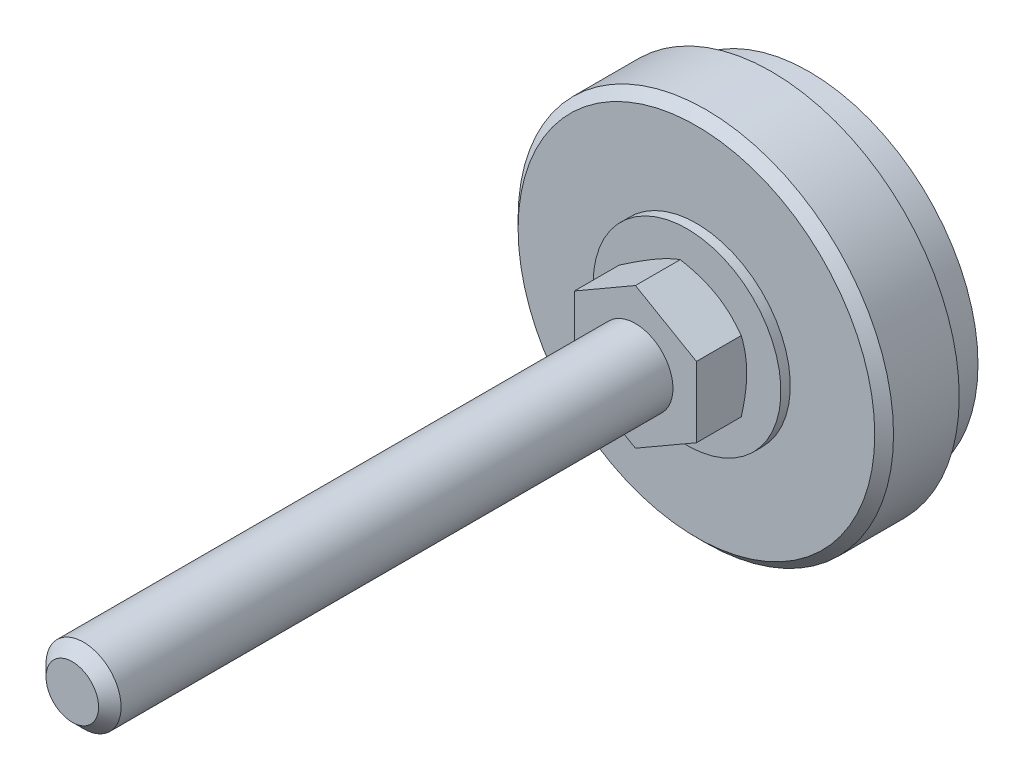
ISO-10303-21;
HEADER;
FILE_DESCRIPTION(('STEP AP214'),'2;1');
FILE_NAME('part.step','',(''),(''),'','','');
FILE_SCHEMA(('AUTOMOTIVE_DESIGN { 1 0 10303 214 1 1 1 1 }'));
ENDSEC;
DATA;
#1=APPLICATION_CONTEXT('core data for automotive mechanical design processes');
#2=APPLICATION_PROTOCOL_DEFINITION('international standard','automotive_design',2000,#1);
#3=PRODUCT_CONTEXT('',#1,'mechanical');
#4=PRODUCT('Part','Part','',(#3));
#5=PRODUCT_RELATED_PRODUCT_CATEGORY('part','',(#4));
#6=PRODUCT_DEFINITION_FORMATION('','',#4);
#7=PRODUCT_DEFINITION_CONTEXT('part definition',#1,'design');
#8=PRODUCT_DEFINITION('design','',#6,#7);
#9=PRODUCT_DEFINITION_SHAPE('','',#8);
#10=(LENGTH_UNIT() NAMED_UNIT(*) SI_UNIT(.MILLI.,.METRE.));
#11=(NAMED_UNIT(*) PLANE_ANGLE_UNIT() SI_UNIT($,.RADIAN.));
#12=(NAMED_UNIT(*) SI_UNIT($,.STERADIAN.) SOLID_ANGLE_UNIT());
#13=UNCERTAINTY_MEASURE_WITH_UNIT(LENGTH_MEASURE(1.E-05),#10,'distance_accuracy_value','');
#14=(GEOMETRIC_REPRESENTATION_CONTEXT(3) GLOBAL_UNCERTAINTY_ASSIGNED_CONTEXT((#13)) GLOBAL_UNIT_ASSIGNED_CONTEXT((#10,
#11,#12)) REPRESENTATION_CONTEXT('',''));
#15=CARTESIAN_POINT('',(0.,0.,0.));
#16=DIRECTION('',(0.,0.,1.));
#17=DIRECTION('',(1.,0.,0.));
#18=AXIS2_PLACEMENT_3D('',#15,#16,#17);
#19=CARTESIAN_POINT('',(0.,0.,18.5));
#20=DIRECTION('',(0.,0.,1.));
#21=DIRECTION('',(1.,0.,0.));
#22=AXIS2_PLACEMENT_3D('',#19,#20,#21);
#23=PLANE('',#22);
#24=DIRECTION('',(-0.866025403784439,0.5,0.));
#25=VECTOR('',#24,1.);
#26=CARTESIAN_POINT('',(6.5,3.75277674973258,18.5));
#27=LINE('',#26,#25);
#28=CARTESIAN_POINT('',(6.5,3.75277674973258,18.5));
#29=VERTEX_POINT('',#28);
#30=CARTESIAN_POINT('',(0.,7.50555349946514,18.5));
#31=VERTEX_POINT('',#30);
#32=EDGE_CURVE('E225',#29,#31,#27,.T.);
#33=ORIENTED_EDGE('',*,*,#32,.T.);
#34=DIRECTION('',(-0.866025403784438,-0.5,0.));
#35=VECTOR('',#34,1.);
#36=CARTESIAN_POINT('',(0.,7.50555349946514,18.5));
#37=LINE('',#36,#35);
#38=CARTESIAN_POINT('',(-6.5,3.75277674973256,18.5));
#39=VERTEX_POINT('',#38);
#40=EDGE_CURVE('E372',#31,#39,#37,.T.);
#41=ORIENTED_EDGE('',*,*,#40,.T.);
#42=DIRECTION('',(0.,-1.,0.));
#43=VECTOR('',#42,1.);
#44=CARTESIAN_POINT('',(-6.5,3.75277674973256,18.5));
#45=LINE('',#44,#43);
#46=CARTESIAN_POINT('',(-6.5,-3.75277674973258,18.5));
#47=VERTEX_POINT('',#46);
#48=EDGE_CURVE('E371',#39,#47,#45,.T.);
#49=ORIENTED_EDGE('',*,*,#48,.T.);
#50=DIRECTION('',(0.866025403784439,-0.5,0.));
#51=VECTOR('',#50,1.);
#52=CARTESIAN_POINT('',(-6.5,-3.75277674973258,18.5));
#53=LINE('',#52,#51);
#54=CARTESIAN_POINT('',(0.,-7.50555349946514,18.5));
#55=VERTEX_POINT('',#54);
#56=EDGE_CURVE('E376',#47,#55,#53,.T.);
#57=ORIENTED_EDGE('',*,*,#56,.T.);
#58=DIRECTION('',(0.866025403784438,0.5,0.));
#59=VECTOR('',#58,1.);
#60=CARTESIAN_POINT('',(0.,-7.50555349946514,18.5));
#61=LINE('',#60,#59);
#62=CARTESIAN_POINT('',(6.5,-3.75277674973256,18.5));
#63=VERTEX_POINT('',#62);
#64=EDGE_CURVE('E378',#55,#63,#61,.T.);
#65=ORIENTED_EDGE('',*,*,#64,.T.);
#66=DIRECTION('',(0.,1.,0.));
#67=VECTOR('',#66,1.);
#68=CARTESIAN_POINT('',(6.5,-3.75277674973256,18.5));
#69=LINE('',#68,#67);
#70=EDGE_CURVE('E37',#63,#29,#69,.T.);
#71=ORIENTED_EDGE('',*,*,#70,.T.);
#72=EDGE_LOOP('',(#33,#41,#49,#57,#65,#71));
#73=FACE_BOUND('',#72,.T.);
#74=CARTESIAN_POINT('',(0.,0.,18.5));
#75=DIRECTION('',(0.,0.,1.));
#76=DIRECTION('',(1.,0.,0.));
#77=AXIS2_PLACEMENT_3D('',#74,#75,#76);
#78=CIRCLE('',#77,4.);
#79=CARTESIAN_POINT('',(4.,0.,18.5));
#80=VERTEX_POINT('',#79);
#81=EDGE_CURVE('E229',#80,#80,#78,.T.);
#82=ORIENTED_EDGE('',*,*,#81,.F.);
#83=EDGE_LOOP('',(#82));
#84=FACE_BOUND('',#83,.T.);
#85=ADVANCED_FACE('F14',(#73,#84),#23,.T.);
#86=CARTESIAN_POINT('',(0.,0.,13.));
#87=DIRECTION('',(0.,0.,-1.));
#88=DIRECTION('',(-1.,0.,0.));
#89=AXIS2_PLACEMENT_3D('',#86,#87,#88);
#90=PLANE('',#89);
#91=CARTESIAN_POINT('',(0.,0.,13.));
#92=DIRECTION('',(0.,0.,-1.));
#93=DIRECTION('',(-1.,0.,0.));
#94=AXIS2_PLACEMENT_3D('',#91,#92,#93);
#95=CIRCLE('',#94,10.);
#96=CARTESIAN_POINT('',(-10.,0.,13.));
#97=VERTEX_POINT('',#96);
#98=EDGE_CURVE('E73',#97,#97,#95,.T.);
#99=ORIENTED_EDGE('',*,*,#98,.F.);
#100=EDGE_LOOP('',(#99));
#101=FACE_BOUND('',#100,.T.);
#102=CARTESIAN_POINT('',(0.,0.,13.));
#103=DIRECTION('',(0.,0.,-1.));
#104=DIRECTION('',(-1.,0.,0.));
#105=AXIS2_PLACEMENT_3D('',#102,#103,#104);
#106=CIRCLE('',#105,6.25);
#107=CARTESIAN_POINT('',(-6.25,0.,13.));
#108=VERTEX_POINT('',#107);
#109=EDGE_CURVE('E84',#108,#108,#106,.T.);
#110=ORIENTED_EDGE('',*,*,#109,.T.);
#111=EDGE_LOOP('',(#110));
#112=FACE_BOUND('',#111,.T.);
#113=ADVANCED_FACE('F210',(#101,#112),#90,.F.);
#114=CARTESIAN_POINT('',(18.,0.,0.));
#115=DIRECTION('',(0.,0.,1.));
#116=DIRECTION('',(1.,0.,0.));
#117=AXIS2_PLACEMENT_3D('',#114,#115,#116);
#118=PLANE('',#117);
#119=CARTESIAN_POINT('',(0.,0.,0.));
#120=DIRECTION('',(0.,0.,-1.));
#121=DIRECTION('',(-1.,0.,0.));
#122=AXIS2_PLACEMENT_3D('',#119,#120,#121);
#123=CIRCLE('',#122,18.);
#124=CARTESIAN_POINT('',(-18.,0.,0.));
#125=VERTEX_POINT('',#124);
#126=EDGE_CURVE('E102',#125,#125,#123,.T.);
#127=ORIENTED_EDGE('',*,*,#126,.T.);
#128=EDGE_LOOP('',(#127));
#129=FACE_BOUND('',#128,.T.);
#130=ADVANCED_FACE('F208',(#129),#118,.F.);
#131=CARTESIAN_POINT('',(0.,0.,-17.5528627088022));
#132=DIRECTION('',(0.,0.,-1.));
#133=DIRECTION('',(-1.,0.,0.));
#134=AXIS2_PLACEMENT_3D('',#131,#132,#133);
#135=CYLINDRICAL_SURFACE('',#134,10.);
#136=CARTESIAN_POINT('',(0.,0.,12.));
#137=DIRECTION('',(0.,0.,-1.));
#138=DIRECTION('',(-1.,0.,0.));
#139=AXIS2_PLACEMENT_3D('',#136,#137,#138);
#140=CIRCLE('',#139,10.);
#141=CARTESIAN_POINT('',(-10.,0.,12.));
#142=VERTEX_POINT('',#141);
#143=EDGE_CURVE('E117',#142,#142,#140,.T.);
#144=ORIENTED_EDGE('',*,*,#143,.F.);
#145=EDGE_LOOP('',(#144));
#146=FACE_BOUND('',#145,.T.);
#147=ORIENTED_EDGE('',*,*,#98,.T.);
#148=EDGE_LOOP('',(#147));
#149=FACE_BOUND('',#148,.T.);
#150=ADVANCED_FACE('F204',(#146,#149),#135,.T.);
#151=CARTESIAN_POINT('',(10.,0.,12.));
#152=DIRECTION('',(0.,0.,-1.));
#153=DIRECTION('',(-1.,0.,0.));
#154=AXIS2_PLACEMENT_3D('',#151,#152,#153);
#155=PLANE('',#154);
#156=CARTESIAN_POINT('',(0.,0.,12.));
#157=DIRECTION('',(0.,0.,-1.));
#158=DIRECTION('',(-1.,0.,0.));
#159=AXIS2_PLACEMENT_3D('',#156,#157,#158);
#160=CIRCLE('',#159,19.);
#161=CARTESIAN_POINT('',(-19.,0.,12.));
#162=VERTEX_POINT('',#161);
#163=EDGE_CURVE('E114',#162,#162,#160,.T.);
#164=ORIENTED_EDGE('',*,*,#163,.F.);
#165=EDGE_LOOP('',(#164));
#166=FACE_BOUND('',#165,.T.);
#167=ORIENTED_EDGE('',*,*,#143,.T.);
#168=EDGE_LOOP('',(#167));
#169=FACE_BOUND('',#168,.T.);
#170=ADVANCED_FACE('F200',(#166,#169),#155,.F.);
#171=CARTESIAN_POINT('',(0.,0.,12.));
#172=DIRECTION('',(0.,0.,-1.));
#173=DIRECTION('',(-1.,0.,0.));
#174=AXIS2_PLACEMENT_3D('',#171,#172,#173);
#175=CONICAL_SURFACE('',#174,19.,0.785398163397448);
#176=CARTESIAN_POINT('',(0.,0.,11.));
#177=DIRECTION('',(0.,0.,-1.));
#178=DIRECTION('',(-1.,0.,0.));
#179=AXIS2_PLACEMENT_3D('',#176,#177,#178);
#180=CIRCLE('',#179,20.);
#181=CARTESIAN_POINT('',(-20.,0.,11.));
#182=VERTEX_POINT('',#181);
#183=EDGE_CURVE('E111',#182,#182,#180,.T.);
#184=ORIENTED_EDGE('',*,*,#183,.F.);
#185=EDGE_LOOP('',(#184));
#186=FACE_BOUND('',#185,.T.);
#187=ORIENTED_EDGE('',*,*,#163,.T.);
#188=EDGE_LOOP('',(#187));
#189=FACE_BOUND('',#188,.T.);
#190=ADVANCED_FACE('F196',(#186,#189),#175,.T.);
#191=CARTESIAN_POINT('',(0.,0.,-17.5528627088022));
#192=DIRECTION('',(0.,0.,-1.));
#193=DIRECTION('',(-1.,0.,0.));
#194=AXIS2_PLACEMENT_3D('',#191,#192,#193);
#195=CYLINDRICAL_SURFACE('',#194,20.);
#196=CARTESIAN_POINT('',(0.,0.,4.));
#197=DIRECTION('',(0.,0.,-1.));
#198=DIRECTION('',(-1.,0.,0.));
#199=AXIS2_PLACEMENT_3D('',#196,#197,#198);
#200=CIRCLE('',#199,20.);
#201=CARTESIAN_POINT('',(-20.,0.,4.));
#202=VERTEX_POINT('',#201);
#203=EDGE_CURVE('E108',#202,#202,#200,.T.);
#204=ORIENTED_EDGE('',*,*,#203,.F.);
#205=EDGE_LOOP('',(#204));
#206=FACE_BOUND('',#205,.T.);
#207=ORIENTED_EDGE('',*,*,#183,.T.);
#208=EDGE_LOOP('',(#207));
#209=FACE_BOUND('',#208,.T.);
#210=ADVANCED_FACE('F192',(#206,#209),#195,.T.);
#211=CARTESIAN_POINT('',(18.,0.,4.));
#212=DIRECTION('',(0.,0.,1.));
#213=DIRECTION('',(1.,0.,0.));
#214=AXIS2_PLACEMENT_3D('',#211,#212,#213);
#215=PLANE('',#214);
#216=CARTESIAN_POINT('',(0.,0.,4.));
#217=DIRECTION('',(0.,0.,-1.));
#218=DIRECTION('',(-1.,0.,0.));
#219=AXIS2_PLACEMENT_3D('',#216,#217,#218);
#220=CIRCLE('',#219,18.);
#221=CARTESIAN_POINT('',(-18.,0.,4.));
#222=VERTEX_POINT('',#221);
#223=EDGE_CURVE('E105',#222,#222,#220,.T.);
#224=ORIENTED_EDGE('',*,*,#223,.F.);
#225=EDGE_LOOP('',(#224));
#226=FACE_BOUND('',#225,.T.);
#227=ORIENTED_EDGE('',*,*,#203,.T.);
#228=EDGE_LOOP('',(#227));
#229=FACE_BOUND('',#228,.T.);
#230=ADVANCED_FACE('F188',(#226,#229),#215,.F.);
#231=CARTESIAN_POINT('',(0.,0.,-17.5528627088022));
#232=DIRECTION('',(0.,0.,-1.));
#233=DIRECTION('',(-1.,0.,0.));
#234=AXIS2_PLACEMENT_3D('',#231,#232,#233);
#235=CYLINDRICAL_SURFACE('',#234,18.);
#236=ORIENTED_EDGE('',*,*,#126,.F.);
#237=EDGE_LOOP('',(#236));
#238=FACE_BOUND('',#237,.T.);
#239=ORIENTED_EDGE('',*,*,#223,.T.);
#240=EDGE_LOOP('',(#239));
#241=FACE_BOUND('',#240,.T.);
#242=ADVANCED_FACE('F133',(#238,#241),#235,.T.);
#243=CARTESIAN_POINT('',(0.,0.,15.4511353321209));
#244=DIRECTION('',(0.,0.,1.));
#245=DIRECTION('',(1.,0.,0.));
#246=AXIS2_PLACEMENT_3D('',#243,#244,#245);
#247=CONICAL_SURFACE('',#246,10.4954909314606,1.0471975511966);
#248=ORIENTED_EDGE('',*,*,#109,.F.);
#249=EDGE_LOOP('',(#248));
#250=FACE_BOUND('',#249,.T.);
#251=CARTESIAN_POINT('',(6.5,-10.1740089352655,16.3619854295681));
#252=CARTESIAN_POINT('',(6.5,-9.88931084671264,16.2235076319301));
#253=CARTESIAN_POINT('',(6.50000000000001,-9.60396917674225,16.0863308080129));
#254=CARTESIAN_POINT('',(6.50000000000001,-9.03165677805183,15.8153089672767));
#255=CARTESIAN_POINT('',(6.50000000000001,-8.74468580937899,15.6814644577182));
#256=CARTESIAN_POINT('',(6.5,-8.16733878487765,15.4171836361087));
#257=CARTESIAN_POINT('',(6.5,-7.87695275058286,15.2867690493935));
#258=CARTESIAN_POINT('',(6.5,-7.29390354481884,15.0311532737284));
#259=CARTESIAN_POINT('',(6.5,-7.00124047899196,14.905951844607));
#260=CARTESIAN_POINT('',(6.5,-6.40337553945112,14.6580739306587));
#261=CARTESIAN_POINT('',(6.5,-6.09808071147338,14.5356204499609));
#262=CARTESIAN_POINT('',(6.5,-5.48395373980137,14.2997566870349));
#263=CARTESIAN_POINT('',(6.5,-5.17512120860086,14.186347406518));
#264=CARTESIAN_POINT('',(6.5,-4.55397707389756,13.9714805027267));
#265=CARTESIAN_POINT('',(6.5,-4.2416736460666,13.869999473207));
#266=CARTESIAN_POINT('',(6.5,-3.61258417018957,13.6821845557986));
#267=CARTESIAN_POINT('',(6.5,-3.29579953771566,13.5958459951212));
#268=CARTESIAN_POINT('',(6.5,-2.65935923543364,13.4428578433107));
#269=CARTESIAN_POINT('',(6.5,-2.33973044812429,13.3760981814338));
#270=CARTESIAN_POINT('',(6.5,-1.69635601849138,13.2659884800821));
#271=CARTESIAN_POINT('',(6.5,-1.37261079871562,13.2226360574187));
#272=CARTESIAN_POINT('',(6.5,-0.887351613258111,13.1780373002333));
#273=CARTESIAN_POINT('',(6.5,-0.726736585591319,13.1665861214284));
#274=CARTESIAN_POINT('',(6.5,-0.405158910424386,13.1504850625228));
#275=CARTESIAN_POINT('',(6.5,-0.244196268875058,13.1458350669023));
#276=CARTESIAN_POINT('',(6.5,0.0777797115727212,13.1434550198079));
#277=CARTESIAN_POINT('',(6.5,0.238793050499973,13.1457249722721));
#278=CARTESIAN_POINT('',(6.5,0.560579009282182,13.1571261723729));
#279=CARTESIAN_POINT('',(6.5,0.721351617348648,13.166257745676));
#280=CARTESIAN_POINT('',(6.5,1.10492530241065,13.1960343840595));
#281=CARTESIAN_POINT('',(6.5,1.32749106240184,13.2197789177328));
#282=CARTESIAN_POINT('',(6.49999999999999,1.77102132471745,13.2791442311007));
#283=CARTESIAN_POINT('',(6.49999999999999,1.99198561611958,13.3147665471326));
#284=CARTESIAN_POINT('',(6.49999999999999,2.65219460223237,13.4375656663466));
#285=CARTESIAN_POINT('',(6.49999999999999,3.08852172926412,13.5406540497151));
#286=CARTESIAN_POINT('',(6.49999999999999,3.74109084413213,13.7200713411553));
#287=CARTESIAN_POINT('',(6.49999999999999,3.96069988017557,13.7848638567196));
#288=CARTESIAN_POINT('',(6.49999999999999,4.39778655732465,13.9213419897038));
#289=CARTESIAN_POINT('',(6.49999999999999,4.6152641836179,13.9930276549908));
#290=CARTESIAN_POINT('',(6.49999999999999,5.04815352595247,14.1421283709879));
#291=CARTESIAN_POINT('',(6.49999999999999,5.26356585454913,14.2195416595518));
#292=CARTESIAN_POINT('',(6.49999999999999,5.69259456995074,14.3791704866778));
#293=CARTESIAN_POINT('',(6.5,5.90621098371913,14.4613859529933));
#294=CARTESIAN_POINT('',(6.5,6.43247665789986,14.6696466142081));
#295=CARTESIAN_POINT('',(6.49999999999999,6.74419681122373,14.7980360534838));
#296=CARTESIAN_POINT('',(6.49999999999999,7.36479090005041,15.0615401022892));
#297=CARTESIAN_POINT('',(6.49999999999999,7.67366461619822,15.1966552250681));
#298=CARTESIAN_POINT('',(6.49999999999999,8.28913430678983,15.4721854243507));
#299=CARTESIAN_POINT('',(6.49999999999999,8.59572962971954,15.6126019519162));
#300=CARTESIAN_POINT('',(6.49999999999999,9.20696208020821,15.8976014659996));
#301=CARTESIAN_POINT('',(6.49999999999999,9.51159926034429,16.0421843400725));
#302=CARTESIAN_POINT('',(6.49999999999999,10.1196466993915,16.3348797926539));
#303=CARTESIAN_POINT('',(6.49999999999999,10.4230549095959,16.4829966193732));
#304=CARTESIAN_POINT('',(6.49999999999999,11.0285264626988,16.7819566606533));
#305=CARTESIAN_POINT('',(6.49999999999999,11.3305897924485,16.9327999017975));
#306=CARTESIAN_POINT('',(6.49999999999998,12.2350030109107,17.3886086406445));
#307=CARTESIAN_POINT('',(6.49999999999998,12.8356755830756,17.6969014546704));
#308=CARTESIAN_POINT('',(6.49999999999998,13.9793118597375,18.2912863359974));
#309=CARTESIAN_POINT('',(6.49999999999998,14.5225535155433,18.5768461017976));
#310=CARTESIAN_POINT('',(6.49999999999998,15.6070575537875,19.1517540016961));
#311=CARTESIAN_POINT('',(6.49999999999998,16.1483198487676,19.4411023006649));
#312=CARTESIAN_POINT('',(6.49999999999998,17.2277843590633,20.0218350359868));
#313=CARTESIAN_POINT('',(6.49999999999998,17.7659908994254,20.3132114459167));
#314=CARTESIAN_POINT('',(6.49999999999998,18.8411510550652,20.8981872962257));
#315=CARTESIAN_POINT('',(6.49999999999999,19.3781047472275,21.1917865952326));
#316=CARTESIAN_POINT('',(6.5,19.9146043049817,21.4862079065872));
#317=B_SPLINE_CURVE_WITH_KNOTS('',3,(#251,#252,#253,#254,#255,#256,#257,#258,#259,#260,#261,
#262,#263,#264,#265,#266,#267,#268,#269,#270,#271,#272,#273,#274,#275,#276,#277,#278,#279,#280,
#281,#282,#283,#284,#285,#286,#287,#288,#289,#290,#291,#292,#293,#294,#295,#296,#297,#298,#299,
#300,#301,#302,#303,#304,#305,#306,#307,#308,#309,#310,#311,#312,#313,#314,#315,#316),
.UNSPECIFIED.,.F.,.F.,(4,2,2,2,2,2,2,2,2,2,2,2,2,2,2,2,2,2,2,2,2,2,2,2,2,2,2,2,2,2,2,2,4),(0.,
0.949780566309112,1.89970483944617,2.85464445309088,3.80954002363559,4.79624142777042,
5.7830519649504,6.76789260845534,7.75242880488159,8.73131899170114,9.71010949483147,
10.1930555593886,10.6759934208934,11.1589315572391,11.6418926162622,12.3130017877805,
12.9841977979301,14.3272903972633,15.0141336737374,15.7009817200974,16.3876193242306,
17.0742466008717,18.0855116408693,19.096853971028,20.1084751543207,21.1200690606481,
22.1329472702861,23.1458353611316,25.1712798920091,27.012433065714,28.8536666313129,
30.6897162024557,32.5256499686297),.UNSPECIFIED.);
#318=CARTESIAN_POINT('',(6.5,-3.75277674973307,13.7248941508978));
#319=VERTEX_POINT('',#318);
#320=CARTESIAN_POINT('',(6.5,3.75277674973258,13.7248941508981));
#321=VERTEX_POINT('',#320);
#322=EDGE_CURVE('E65',#319,#321,#317,.T.);
#323=ORIENTED_EDGE('',*,*,#322,.F.);
#324=CARTESIAN_POINT('',(-0.000200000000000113,-7.50566896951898,13.7249608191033));
#325=CARTESIAN_POINT('',(0.14267745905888,-7.42317863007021,13.6773419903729));
#326=CARTESIAN_POINT('',(0.286087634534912,-7.34038072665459,13.6318842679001));
#327=CARTESIAN_POINT('',(0.574072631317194,-7.17411251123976,13.5458862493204));
#328=CARTESIAN_POINT('',(0.718647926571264,-7.09064192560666,13.5053480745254));
#329=CARTESIAN_POINT('',(1.15468865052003,-6.83889369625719,13.3919085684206));
#330=CARTESIAN_POINT('',(1.44787528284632,-6.66962231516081,13.3273853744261));
#331=CARTESIAN_POINT('',(1.88662374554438,-6.41631077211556,13.2517241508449));
#332=CARTESIAN_POINT('',(2.03087463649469,-6.33302748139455,13.2301704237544));
#333=CARTESIAN_POINT('',(2.32002821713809,-6.16608458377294,13.1940278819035));
#334=CARTESIAN_POINT('',(2.46493084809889,-6.08242501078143,13.1794384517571));
#335=CARTESIAN_POINT('',(2.75498777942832,-5.91496056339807,13.1575963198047));
#336=CARTESIAN_POINT('',(2.90014160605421,-5.83115596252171,13.1503352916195));
#337=CARTESIAN_POINT('',(3.19057533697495,-5.66347396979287,13.1432978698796));
#338=CARTESIAN_POINT('',(3.33585523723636,-5.5795965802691,13.1435212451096));
#339=CARTESIAN_POINT('',(3.73387594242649,-5.34979921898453,13.1544210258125));
#340=CARTESIAN_POINT('',(3.98648646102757,-5.20395446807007,13.1727193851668));
#341=CARTESIAN_POINT('',(4.49002967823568,-4.91323365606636,13.2307439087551));
#342=CARTESIAN_POINT('',(4.74096060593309,-4.76835861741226,13.2704899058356));
#343=CARTESIAN_POINT('',(5.24551722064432,-4.47705272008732,13.3698434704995));
#344=CARTESIAN_POINT('',(5.49907924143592,-4.33065861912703,13.4298719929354));
#345=CARTESIAN_POINT('',(6.00242193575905,-4.04005357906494,13.5661125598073));
#346=CARTESIAN_POINT('',(6.25220905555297,-3.89583891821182,13.642292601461));
#347=CARTESIAN_POINT('',(6.5002,-3.75266127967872,13.7249608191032));
#348=B_SPLINE_CURVE_WITH_KNOTS('',3,(#324,#325,#326,#327,#328,#329,#330,#331,#332,#333,#334,
#335,#336,#337,#338,#339,#340,#341,#342,#343,#344,#345,#346,#347),.UNSPECIFIED.,.F.,.F.,(4,2,2,
2,2,2,2,2,2,2,2,4),(0.,0.515105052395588,1.03043143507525,2.06322554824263,2.56697389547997,
3.07067772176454,3.57380860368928,4.0769239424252,4.9527935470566,5.82947446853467,
6.72559912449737,7.61996451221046),.UNSPECIFIED.);
#349=CARTESIAN_POINT('',(0.,-7.50555349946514,13.7248941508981));
#350=VERTEX_POINT('',#349);
#351=EDGE_CURVE('E68',#350,#319,#348,.T.);
#352=ORIENTED_EDGE('',*,*,#351,.F.);
#353=CARTESIAN_POINT('',(-6.5002,-3.75266127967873,13.7249608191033));
#354=CARTESIAN_POINT('',(-6.35732254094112,-3.83515161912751,13.6773419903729));
#355=CARTESIAN_POINT('',(-6.21391236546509,-3.91794952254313,13.6318842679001));
#356=CARTESIAN_POINT('',(-5.92592736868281,-4.08421773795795,13.5458862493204));
#357=CARTESIAN_POINT('',(-5.78135207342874,-4.16768832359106,13.5053480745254));
#358=CARTESIAN_POINT('',(-5.34531134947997,-4.41943655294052,13.3919085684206));
#359=CARTESIAN_POINT('',(-5.05212471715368,-4.5887079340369,13.3273853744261));
#360=CARTESIAN_POINT('',(-4.61337625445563,-4.84201947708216,13.2517241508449));
#361=CARTESIAN_POINT('',(-4.46912536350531,-4.92530276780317,13.2301704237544));
#362=CARTESIAN_POINT('',(-4.17997178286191,-5.09224566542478,13.1940278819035));
#363=CARTESIAN_POINT('',(-4.03506915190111,-5.17590523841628,13.1794384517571));
#364=CARTESIAN_POINT('',(-3.74501222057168,-5.34336968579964,13.1575963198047));
#365=CARTESIAN_POINT('',(-3.59985839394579,-5.427174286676,13.1503352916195));
#366=CARTESIAN_POINT('',(-3.30942466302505,-5.59485627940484,13.1432978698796));
#367=CARTESIAN_POINT('',(-3.16414476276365,-5.67873366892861,13.1435212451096));
#368=CARTESIAN_POINT('',(-2.76612405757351,-5.90853103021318,13.1544210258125));
#369=CARTESIAN_POINT('',(-2.51351353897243,-6.05437578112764,13.1727193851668));
#370=CARTESIAN_POINT('',(-2.00997032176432,-6.34509659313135,13.2307439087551));
#371=CARTESIAN_POINT('',(-1.75903939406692,-6.48997163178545,13.2704899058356));
#372=CARTESIAN_POINT('',(-1.25448277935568,-6.78127752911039,13.3698434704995));
#373=CARTESIAN_POINT('',(-1.00092075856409,-6.92767163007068,13.4298719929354));
#374=CARTESIAN_POINT('',(-0.497578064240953,-7.21827667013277,13.5661125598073));
#375=CARTESIAN_POINT('',(-0.247790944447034,-7.36249133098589,13.642292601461));
#376=CARTESIAN_POINT('',(0.000200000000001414,-7.50566896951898,13.7249608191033));
#377=B_SPLINE_CURVE_WITH_KNOTS('',3,(#353,#354,#355,#356,#357,#358,#359,#360,#361,#362,#363,
#364,#365,#366,#367,#368,#369,#370,#371,#372,#373,#374,#375,#376),.UNSPECIFIED.,.F.,.F.,(4,2,2,
2,2,2,2,2,2,2,2,4),(0.,0.515105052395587,1.03043143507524,2.06322554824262,2.56697389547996,
3.07067772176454,3.57380860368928,4.0769239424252,4.9527935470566,5.82947446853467,
6.72559912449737,7.61996451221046),.UNSPECIFIED.);
#378=CARTESIAN_POINT('',(-6.5,-3.75277674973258,13.7248941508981));
#379=VERTEX_POINT('',#378);
#380=EDGE_CURVE('E83',#379,#350,#377,.T.);
#381=ORIENTED_EDGE('',*,*,#380,.F.);
#382=CARTESIAN_POINT('',(-6.5,-10.174008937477,16.361985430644));
#383=CARTESIAN_POINT('',(-6.5,-9.88931084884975,16.2235076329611));
#384=CARTESIAN_POINT('',(-6.49999999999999,-9.60396917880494,16.0863308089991));
#385=CARTESIAN_POINT('',(-6.49999999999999,-9.03165677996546,15.8153089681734));
#386=CARTESIAN_POINT('',(-6.5,-8.74468581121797,15.6814644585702));
#387=CARTESIAN_POINT('',(-6.5,-8.1673387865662,15.4171836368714));
#388=CARTESIAN_POINT('',(-6.5,-7.8769527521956,15.2867690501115));
#389=CARTESIAN_POINT('',(-6.5,-7.29390354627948,15.0311532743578));
#390=CARTESIAN_POINT('',(-6.5,-7.00124048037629,14.9059518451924));
#391=CARTESIAN_POINT('',(-6.5,-6.40337554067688,14.658073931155));
#392=CARTESIAN_POINT('',(-6.5,-6.09808071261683,14.5356204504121));
#393=CARTESIAN_POINT('',(-6.5,-5.48395374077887,14.2997566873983));
#394=CARTESIAN_POINT('',(-6.5,-5.17512120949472,14.1863474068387));
#395=CARTESIAN_POINT('',(-6.5,-4.5539770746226,13.971480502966));
#396=CARTESIAN_POINT('',(-6.5,-4.24167364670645,13.8699994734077));
#397=CARTESIAN_POINT('',(-6.5,-3.61258417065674,13.6821845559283));
#398=CARTESIAN_POINT('',(-6.5,-3.29579953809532,13.5958459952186));
#399=CARTESIAN_POINT('',(-6.5,-2.65935923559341,13.442857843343));
#400=CARTESIAN_POINT('',(-6.5,-2.33973044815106,13.3760981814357));
#401=CARTESIAN_POINT('',(-6.5,-1.69635601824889,13.2659884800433));
#402=CARTESIAN_POINT('',(-6.5,-1.37261079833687,13.2226360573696));
#403=CARTESIAN_POINT('',(-6.5,-0.887351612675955,13.1780373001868));
#404=CARTESIAN_POINT('',(-6.5,-0.726736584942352,13.1665861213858));
#405=CARTESIAN_POINT('',(-6.5,-0.405158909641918,13.1504850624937));
#406=CARTESIAN_POINT('',(-6.5,-0.244196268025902,13.1458350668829));
#407=CARTESIAN_POINT('',(-6.5,0.0777797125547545,13.1434550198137));
#408=CARTESIAN_POINT('',(-6.5,0.238793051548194,13.1457249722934));
#409=CARTESIAN_POINT('',(-6.5,0.560579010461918,13.1571261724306));
#410=CARTESIAN_POINT('',(-6.5,0.72135161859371,13.1662577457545));
#411=CARTESIAN_POINT('',(-6.5,1.10492530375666,13.1960343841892));
#412=CARTESIAN_POINT('',(-6.5,1.32749106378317,13.2197789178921));
#413=CARTESIAN_POINT('',(-6.5,1.77102132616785,13.2791442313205));
#414=CARTESIAN_POINT('',(-6.5,1.99198561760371,13.3147665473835));
#415=CARTESIAN_POINT('',(-6.5,2.65219460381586,13.4375656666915));
#416=CARTESIAN_POINT('',(-6.5,3.08852173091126,13.5406540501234));
#417=CARTESIAN_POINT('',(-6.5,3.74109084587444,13.7200713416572));
#418=CARTESIAN_POINT('',(-6.5,3.96069988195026,13.7848638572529));
#419=CARTESIAN_POINT('',(-6.5,4.39778655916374,13.9213419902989));
#420=CARTESIAN_POINT('',(-6.5,4.61526418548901,13.9930276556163));
#421=CARTESIAN_POINT('',(-6.5,5.04815352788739,14.1421283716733));
#422=CARTESIAN_POINT('',(-6.5,5.26356585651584,14.2195416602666));
#423=CARTESIAN_POINT('',(-6.5,5.69259457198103,14.3791704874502));
#424=CARTESIAN_POINT('',(-6.5,5.90621098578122,14.461385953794));
#425=CARTESIAN_POINT('',(-6.5,6.43247665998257,14.6696466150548));
#426=CARTESIAN_POINT('',(-6.5,6.74419681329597,14.798036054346));
#427=CARTESIAN_POINT('',(-6.5,7.36479090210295,15.0615401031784));
#428=CARTESIAN_POINT('',(-6.5,7.67366461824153,15.1966552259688));
#429=CARTESIAN_POINT('',(-6.5,8.28913430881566,15.4721854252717));
#430=CARTESIAN_POINT('',(-6.5,8.59572963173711,15.6126019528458));
#431=CARTESIAN_POINT('',(-6.5,9.20696208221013,15.8976014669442));
#432=CARTESIAN_POINT('',(-6.5,9.51159926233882,16.0421843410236));
#433=CARTESIAN_POINT('',(-6.5,10.1196467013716,16.3348797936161));
#434=CARTESIAN_POINT('',(-6.5,10.4230549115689,16.48299662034));
#435=CARTESIAN_POINT('',(-6.5,11.0285264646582,16.7819566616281));
#436=CARTESIAN_POINT('',(-6.5,11.3305897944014,16.9327999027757));
#437=CARTESIAN_POINT('',(-6.5,12.2350030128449,17.3886086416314));
#438=CARTESIAN_POINT('',(-6.5,12.8356755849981,17.6969014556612));
#439=CARTESIAN_POINT('',(-6.5,13.9793118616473,18.2912863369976));
#440=CARTESIAN_POINT('',(-6.5,14.5225535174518,18.5768461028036));
#441=CARTESIAN_POINT('',(-6.5,15.6070575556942,19.1517540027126));
#442=CARTESIAN_POINT('',(-6.5,16.1483198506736,19.4411023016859));
#443=CARTESIAN_POINT('',(-6.50000000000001,17.2277843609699,20.0218350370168));
#444=CARTESIAN_POINT('',(-6.50000000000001,17.7659909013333,20.3132114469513));
#445=CARTESIAN_POINT('',(-6.50000000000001,18.841151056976,20.8981872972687));
#446=CARTESIAN_POINT('',(-6.5,19.37810474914,21.1917865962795));
#447=CARTESIAN_POINT('',(-6.5,19.9146043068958,21.4862079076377));
#448=B_SPLINE_CURVE_WITH_KNOTS('',3,(#382,#383,#384,#385,#386,#387,#388,#389,#390,#391,#392,
#393,#394,#395,#396,#397,#398,#399,#400,#401,#402,#403,#404,#405,#406,#407,#408,#409,#410,#411,
#412,#413,#414,#415,#416,#417,#418,#419,#420,#421,#422,#423,#424,#425,#426,#427,#428,#429,#430,
#431,#432,#433,#434,#435,#436,#437,#438,#439,#440,#441,#442,#443,#444,#445,#446,#447),
.UNSPECIFIED.,.F.,.F.,(4,2,2,2,2,2,2,2,2,2,2,2,2,2,2,2,2,2,2,2,2,2,2,2,2,2,2,2,2,2,2,2,4),(0.,
0.94978056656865,1.89970483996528,2.85464445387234,3.80954002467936,4.79624142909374,
5.78305196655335,6.767892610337,7.75242880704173,8.73131899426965,9.71010949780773,
10.1930555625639,10.6759934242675,11.1589315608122,11.6418926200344,12.3130017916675,
12.9841978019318,14.3272904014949,15.0141336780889,15.7009817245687,16.3876193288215,
17.0742466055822,18.0855116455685,19.0968539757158,20.1084751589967,21.1200690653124,
22.1329472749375,23.1458353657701,25.171279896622,27.0124330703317,28.8536666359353,
30.6897162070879,32.5256499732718),.UNSPECIFIED.);
#449=CARTESIAN_POINT('',(-6.5,3.75277674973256,13.7248941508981));
#450=VERTEX_POINT('',#449);
#451=EDGE_CURVE('E155',#450,#379,#448,.F.);
#452=ORIENTED_EDGE('',*,*,#451,.F.);
#453=CARTESIAN_POINT('',(0.000200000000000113,7.50566896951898,13.7249608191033));
#454=CARTESIAN_POINT('',(-0.14267745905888,7.42317863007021,13.6773419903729));
#455=CARTESIAN_POINT('',(-0.286087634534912,7.34038072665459,13.6318842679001));
#456=CARTESIAN_POINT('',(-0.574072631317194,7.17411251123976,13.5458862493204));
#457=CARTESIAN_POINT('',(-0.718647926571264,7.09064192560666,13.5053480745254));
#458=CARTESIAN_POINT('',(-1.15468865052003,6.83889369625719,13.3919085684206));
#459=CARTESIAN_POINT('',(-1.44787528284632,6.66962231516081,13.3273853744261));
#460=CARTESIAN_POINT('',(-1.88662374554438,6.41631077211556,13.2517241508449));
#461=CARTESIAN_POINT('',(-2.03087463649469,6.33302748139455,13.2301704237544));
#462=CARTESIAN_POINT('',(-2.32002821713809,6.16608458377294,13.1940278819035));
#463=CARTESIAN_POINT('',(-2.46493084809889,6.08242501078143,13.1794384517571));
#464=CARTESIAN_POINT('',(-2.75498777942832,5.91496056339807,13.1575963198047));
#465=CARTESIAN_POINT('',(-2.90014160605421,5.83115596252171,13.1503352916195));
#466=CARTESIAN_POINT('',(-3.19057533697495,5.66347396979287,13.1432978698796));
#467=CARTESIAN_POINT('',(-3.33585523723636,5.5795965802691,13.1435212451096));
#468=CARTESIAN_POINT('',(-3.73387594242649,5.34979921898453,13.1544210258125));
#469=CARTESIAN_POINT('',(-3.98648646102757,5.20395446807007,13.1727193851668));
#470=CARTESIAN_POINT('',(-4.49002967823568,4.91323365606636,13.2307439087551));
#471=CARTESIAN_POINT('',(-4.74096060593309,4.76835861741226,13.2704899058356));
#472=CARTESIAN_POINT('',(-5.24551722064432,4.47705272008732,13.3698434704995));
#473=CARTESIAN_POINT('',(-5.49907924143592,4.33065861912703,13.4298719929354));
#474=CARTESIAN_POINT('',(-6.00242193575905,4.04005357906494,13.5661125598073));
#475=CARTESIAN_POINT('',(-6.25220905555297,3.89583891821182,13.642292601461));
#476=CARTESIAN_POINT('',(-6.5002,3.75266127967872,13.7249608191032));
#477=B_SPLINE_CURVE_WITH_KNOTS('',3,(#453,#454,#455,#456,#457,#458,#459,#460,#461,#462,#463,
#464,#465,#466,#467,#468,#469,#470,#471,#472,#473,#474,#475,#476),.UNSPECIFIED.,.F.,.F.,(4,2,2,
2,2,2,2,2,2,2,2,4),(0.,0.515105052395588,1.03043143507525,2.06322554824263,2.56697389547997,
3.07067772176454,3.57380860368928,4.0769239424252,4.9527935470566,5.82947446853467,
6.72559912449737,7.61996451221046),.UNSPECIFIED.);
#478=CARTESIAN_POINT('',(0.,7.50555349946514,13.7248941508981));
#479=VERTEX_POINT('',#478);
#480=EDGE_CURVE('E162',#479,#450,#477,.T.);
#481=ORIENTED_EDGE('',*,*,#480,.F.);
#482=CARTESIAN_POINT('',(6.5002,3.75266127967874,13.7249608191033));
#483=CARTESIAN_POINT('',(6.35732254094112,3.83515161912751,13.6773419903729));
#484=CARTESIAN_POINT('',(6.21391236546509,3.91794952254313,13.6318842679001));
#485=CARTESIAN_POINT('',(5.9259273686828,4.08421773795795,13.5458862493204));
#486=CARTESIAN_POINT('',(5.78135207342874,4.16768832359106,13.5053480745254));
#487=CARTESIAN_POINT('',(5.34531134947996,4.41943655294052,13.3919085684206));
#488=CARTESIAN_POINT('',(5.05212471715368,4.5887079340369,13.3273853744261));
#489=CARTESIAN_POINT('',(4.61337625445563,4.84201947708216,13.2517241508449));
#490=CARTESIAN_POINT('',(4.46912536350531,4.92530276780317,13.2301704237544));
#491=CARTESIAN_POINT('',(4.17997178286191,5.09224566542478,13.1940278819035));
#492=CARTESIAN_POINT('',(4.03506915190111,5.17590523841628,13.1794384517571));
#493=CARTESIAN_POINT('',(3.74501222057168,5.34336968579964,13.1575963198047));
#494=CARTESIAN_POINT('',(3.59985839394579,5.42717428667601,13.1503352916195));
#495=CARTESIAN_POINT('',(3.30942466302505,5.59485627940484,13.1432978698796));
#496=CARTESIAN_POINT('',(3.16414476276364,5.67873366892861,13.1435212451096));
#497=CARTESIAN_POINT('',(2.76612405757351,5.90853103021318,13.1544210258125));
#498=CARTESIAN_POINT('',(2.51351353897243,6.05437578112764,13.1727193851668));
#499=CARTESIAN_POINT('',(2.00997032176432,6.34509659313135,13.2307439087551));
#500=CARTESIAN_POINT('',(1.75903939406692,6.48997163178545,13.2704899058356));
#501=CARTESIAN_POINT('',(1.25448277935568,6.78127752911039,13.3698434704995));
#502=CARTESIAN_POINT('',(1.00092075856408,6.92767163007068,13.4298719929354));
#503=CARTESIAN_POINT('',(0.497578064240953,7.21827667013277,13.5661125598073));
#504=CARTESIAN_POINT('',(0.247790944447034,7.36249133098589,13.642292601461));
#505=CARTESIAN_POINT('',(-0.000200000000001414,7.50566896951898,13.7249608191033));
#506=B_SPLINE_CURVE_WITH_KNOTS('',3,(#482,#483,#484,#485,#486,#487,#488,#489,#490,#491,#492,
#493,#494,#495,#496,#497,#498,#499,#500,#501,#502,#503,#504,#505),.UNSPECIFIED.,.F.,.F.,(4,2,2,
2,2,2,2,2,2,2,2,4),(0.,0.515105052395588,1.03043143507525,2.06322554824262,2.56697389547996,
3.07067772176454,3.57380860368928,4.0769239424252,4.9527935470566,5.82947446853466,
6.72559912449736,7.61996451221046),.UNSPECIFIED.);
#507=EDGE_CURVE('E29',#321,#479,#506,.T.);
#508=ORIENTED_EDGE('',*,*,#507,.F.);
#509=EDGE_LOOP('',(#323,#352,#381,#452,#481,#508));
#510=FACE_BOUND('',#509,.T.);
#511=ADVANCED_FACE('F67',(#250,#510),#247,.T.);
#512=CARTESIAN_POINT('',(6.5,-3.75277674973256,18.5));
#513=DIRECTION('',(-1.,0.,0.));
#514=DIRECTION('',(0.,0.,1.));
#515=AXIS2_PLACEMENT_3D('',#512,#513,#514);
#516=PLANE('',#515);
#517=DIRECTION('',(0.,0.,-1.));
#518=VECTOR('',#517,1.);
#519=CARTESIAN_POINT('',(6.5,-3.75277674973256,18.5));
#520=LINE('',#519,#518);
#521=EDGE_CURVE('E80',#63,#319,#520,.T.);
#522=ORIENTED_EDGE('',*,*,#521,.T.);
#523=ORIENTED_EDGE('',*,*,#322,.T.);
#524=DIRECTION('',(0.,0.,-1.));
#525=VECTOR('',#524,1.);
#526=CARTESIAN_POINT('',(6.5,3.75277674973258,18.5));
#527=LINE('',#526,#525);
#528=EDGE_CURVE('E87',#29,#321,#527,.T.);
#529=ORIENTED_EDGE('',*,*,#528,.F.);
#530=ORIENTED_EDGE('',*,*,#70,.F.);
#531=EDGE_LOOP('',(#522,#523,#529,#530));
#532=FACE_BOUND('',#531,.T.);
#533=ADVANCED_FACE('F86',(#532),#516,.F.);
#534=CARTESIAN_POINT('',(0.,-7.50555349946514,18.5));
#535=DIRECTION('',(-0.5,0.866025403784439,0.));
#536=DIRECTION('',(-0.866025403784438,-0.5,0.));
#537=AXIS2_PLACEMENT_3D('',#534,#535,#536);
#538=PLANE('',#537);
#539=DIRECTION('',(0.,0.,-1.));
#540=VECTOR('',#539,1.);
#541=CARTESIAN_POINT('',(0.,-7.50555349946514,18.5));
#542=LINE('',#541,#540);
#543=EDGE_CURVE('E82',#55,#350,#542,.T.);
#544=ORIENTED_EDGE('',*,*,#543,.T.);
#545=ORIENTED_EDGE('',*,*,#351,.T.);
#546=ORIENTED_EDGE('',*,*,#521,.F.);
#547=ORIENTED_EDGE('',*,*,#64,.F.);
#548=EDGE_LOOP('',(#544,#545,#546,#547));
#549=FACE_BOUND('',#548,.T.);
#550=ADVANCED_FACE('F78',(#549),#538,.F.);
#551=CARTESIAN_POINT('',(-6.5,-3.75277674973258,18.5));
#552=DIRECTION('',(0.5,0.866025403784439,0.));
#553=DIRECTION('',(-0.866025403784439,0.5,0.));
#554=AXIS2_PLACEMENT_3D('',#551,#552,#553);
#555=PLANE('',#554);
#556=DIRECTION('',(0.,0.,-1.));
#557=VECTOR('',#556,1.);
#558=CARTESIAN_POINT('',(-6.5,-3.75277674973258,18.5));
#559=LINE('',#558,#557);
#560=EDGE_CURVE('E89',#47,#379,#559,.T.);
#561=ORIENTED_EDGE('',*,*,#560,.T.);
#562=ORIENTED_EDGE('',*,*,#380,.T.);
#563=ORIENTED_EDGE('',*,*,#543,.F.);
#564=ORIENTED_EDGE('',*,*,#56,.F.);
#565=EDGE_LOOP('',(#561,#562,#563,#564));
#566=FACE_BOUND('',#565,.T.);
#567=ADVANCED_FACE('F349',(#566),#555,.F.);
#568=CARTESIAN_POINT('',(-6.5,3.75277674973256,18.5));
#569=DIRECTION('',(1.,0.,0.));
#570=DIRECTION('',(0.,1.,0.));
#571=AXIS2_PLACEMENT_3D('',#568,#569,#570);
#572=PLANE('',#571);
#573=DIRECTION('',(0.,0.,-1.));
#574=VECTOR('',#573,1.);
#575=CARTESIAN_POINT('',(-6.5,3.75277674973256,18.5));
#576=LINE('',#575,#574);
#577=EDGE_CURVE('E96',#39,#450,#576,.T.);
#578=ORIENTED_EDGE('',*,*,#577,.T.);
#579=ORIENTED_EDGE('',*,*,#451,.T.);
#580=ORIENTED_EDGE('',*,*,#560,.F.);
#581=ORIENTED_EDGE('',*,*,#48,.F.);
#582=EDGE_LOOP('',(#578,#579,#580,#581));
#583=FACE_BOUND('',#582,.T.);
#584=ADVANCED_FACE('F179',(#583),#572,.F.);
#585=CARTESIAN_POINT('',(0.,7.50555349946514,18.5));
#586=DIRECTION('',(0.5,-0.866025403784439,0.));
#587=DIRECTION('',(0.866025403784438,0.5,0.));
#588=AXIS2_PLACEMENT_3D('',#585,#586,#587);
#589=PLANE('',#588);
#590=DIRECTION('',(0.,0.,-1.));
#591=VECTOR('',#590,1.);
#592=CARTESIAN_POINT('',(0.,7.50555349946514,18.5));
#593=LINE('',#592,#591);
#594=EDGE_CURVE('E99',#31,#479,#593,.T.);
#595=ORIENTED_EDGE('',*,*,#594,.T.);
#596=ORIENTED_EDGE('',*,*,#480,.T.);
#597=ORIENTED_EDGE('',*,*,#577,.F.);
#598=ORIENTED_EDGE('',*,*,#40,.F.);
#599=EDGE_LOOP('',(#595,#596,#597,#598));
#600=FACE_BOUND('',#599,.T.);
#601=ADVANCED_FACE('F175',(#600),#589,.F.);
#602=CARTESIAN_POINT('',(6.5,3.75277674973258,18.5));
#603=DIRECTION('',(-0.5,-0.866025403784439,0.));
#604=DIRECTION('',(0.866025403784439,-0.5,0.));
#605=AXIS2_PLACEMENT_3D('',#602,#603,#604);
#606=PLANE('',#605);
#607=ORIENTED_EDGE('',*,*,#528,.T.);
#608=ORIENTED_EDGE('',*,*,#507,.T.);
#609=ORIENTED_EDGE('',*,*,#594,.F.);
#610=ORIENTED_EDGE('',*,*,#32,.F.);
#611=EDGE_LOOP('',(#607,#608,#609,#610));
#612=FACE_BOUND('',#611,.T.);
#613=ADVANCED_FACE('F178',(#612),#606,.F.);
#614=CARTESIAN_POINT('',(0.,0.,78.5));
#615=DIRECTION('',(0.,0.,-1.));
#616=DIRECTION('',(-1.,0.,0.));
#617=AXIS2_PLACEMENT_3D('',#614,#615,#616);
#618=CYLINDRICAL_SURFACE('',#617,4.);
#619=CARTESIAN_POINT('',(0.,0.,77.3));
#620=DIRECTION('',(0.,0.,1.));
#621=DIRECTION('',(1.,0.,0.));
#622=AXIS2_PLACEMENT_3D('',#619,#620,#621);
#623=CIRCLE('',#622,4.);
#624=CARTESIAN_POINT('',(4.,0.,77.3));
#625=VERTEX_POINT('',#624);
#626=EDGE_CURVE('E9',#625,#625,#623,.F.);
#627=ORIENTED_EDGE('',*,*,#626,.T.);
#628=EDGE_LOOP('',(#627));
#629=FACE_BOUND('',#628,.T.);
#630=ORIENTED_EDGE('',*,*,#81,.T.);
#631=EDGE_LOOP('',(#630));
#632=FACE_BOUND('',#631,.T.);
#633=ADVANCED_FACE('F135',(#629,#632),#618,.T.);
#634=CARTESIAN_POINT('',(0.,0.,78.5));
#635=DIRECTION('',(0.,0.,1.));
#636=DIRECTION('',(1.,0.,0.));
#637=AXIS2_PLACEMENT_3D('',#634,#635,#636);
#638=PLANE('',#637);
#639=CARTESIAN_POINT('',(0.,0.,78.5));
#640=DIRECTION('',(0.,0.,1.));
#641=DIRECTION('',(1.,0.,0.));
#642=AXIS2_PLACEMENT_3D('',#639,#640,#641);
#643=CIRCLE('',#642,2.8);
#644=CARTESIAN_POINT('',(2.8,0.,78.5));
#645=VERTEX_POINT('',#644);
#646=EDGE_CURVE('E22',#645,#645,#643,.T.);
#647=ORIENTED_EDGE('',*,*,#646,.T.);
#648=EDGE_LOOP('',(#647));
#649=FACE_BOUND('',#648,.T.);
#650=ADVANCED_FACE('F236',(#649),#638,.T.);
#651=CARTESIAN_POINT('',(0.,0.,78.5));
#652=DIRECTION('',(0.,0.,-1.));
#653=DIRECTION('',(-1.,0.,0.));
#654=AXIS2_PLACEMENT_3D('',#651,#652,#653);
#655=CONICAL_SURFACE('',#654,2.8,0.785398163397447);
#656=ORIENTED_EDGE('',*,*,#626,.F.);
#657=EDGE_LOOP('',(#656));
#658=FACE_BOUND('',#657,.T.);
#659=ORIENTED_EDGE('',*,*,#646,.F.);
#660=EDGE_LOOP('',(#659));
#661=FACE_BOUND('',#660,.T.);
#662=ADVANCED_FACE('F16',(#658,#661),#655,.T.);
#663=CLOSED_SHELL('',(#85,#113,#130,#150,#170,#190,#210,#230,#242,#511,#533,#550,#567,#584,#601,
#613,#633,#650,#662));
#664=MANIFOLD_SOLID_BREP('B1',#663);
#665=ADVANCED_BREP_SHAPE_REPRESENTATION('',(#18,#664),#14);
#666=SHAPE_DEFINITION_REPRESENTATION(#9,#665);
ENDSEC;
END-ISO-10303-21;
